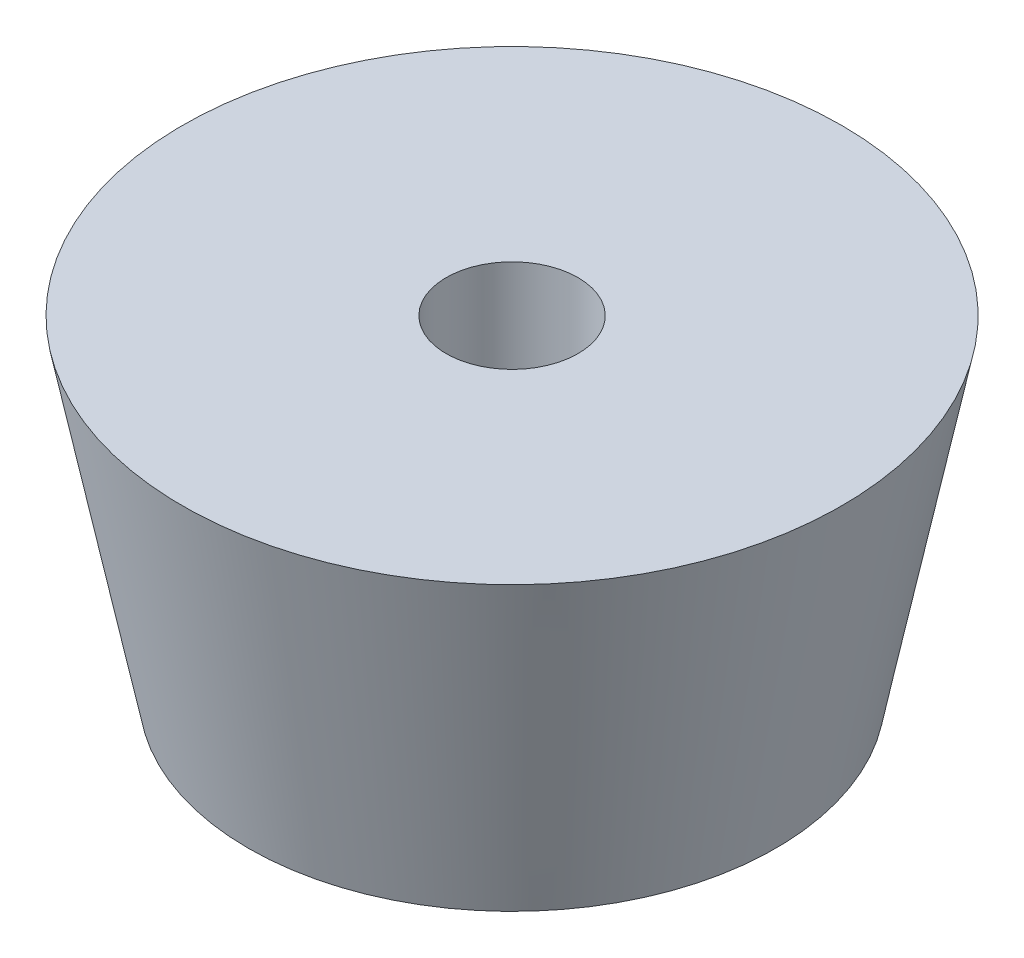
ISO-10303-21;
HEADER;
FILE_DESCRIPTION(('STEP AP214'),'2;1');
FILE_NAME('part.step','',(''),(''),'','','');
FILE_SCHEMA(('AUTOMOTIVE_DESIGN { 1 0 10303 214 1 1 1 1 }'));
ENDSEC;
DATA;
#1=APPLICATION_CONTEXT('core data for automotive mechanical design processes');
#2=APPLICATION_PROTOCOL_DEFINITION('international standard','automotive_design',2000,#1);
#3=PRODUCT_CONTEXT('',#1,'mechanical');
#4=PRODUCT('Part','Part','',(#3));
#5=PRODUCT_RELATED_PRODUCT_CATEGORY('part','',(#4));
#6=PRODUCT_DEFINITION_FORMATION('','',#4);
#7=PRODUCT_DEFINITION_CONTEXT('part definition',#1,'design');
#8=PRODUCT_DEFINITION('design','',#6,#7);
#9=PRODUCT_DEFINITION_SHAPE('','',#8);
#10=(LENGTH_UNIT() NAMED_UNIT(*) SI_UNIT(.MILLI.,.METRE.));
#11=(NAMED_UNIT(*) PLANE_ANGLE_UNIT() SI_UNIT($,.RADIAN.));
#12=(NAMED_UNIT(*) SI_UNIT($,.STERADIAN.) SOLID_ANGLE_UNIT());
#13=UNCERTAINTY_MEASURE_WITH_UNIT(LENGTH_MEASURE(1.E-05),#10,'distance_accuracy_value','');
#14=(GEOMETRIC_REPRESENTATION_CONTEXT(3) GLOBAL_UNCERTAINTY_ASSIGNED_CONTEXT((#13)) GLOBAL_UNIT_ASSIGNED_CONTEXT((#10,
#11,#12)) REPRESENTATION_CONTEXT('',''));
#15=CARTESIAN_POINT('',(0.,0.,0.));
#16=DIRECTION('',(0.,0.,1.));
#17=DIRECTION('',(1.,0.,0.));
#18=AXIS2_PLACEMENT_3D('',#15,#16,#17);
#19=CARTESIAN_POINT('',(0.,0.,0.));
#20=DIRECTION('',(0.,-1.,0.));
#21=DIRECTION('',(0.,0.,-1.));
#22=AXIS2_PLACEMENT_3D('',#19,#20,#21);
#23=CYLINDRICAL_SURFACE('',#22,3.175);
#24=CARTESIAN_POINT('',(0.,15.875,0.));
#25=DIRECTION('',(0.,-1.,0.));
#26=DIRECTION('',(0.,0.,-1.));
#27=AXIS2_PLACEMENT_3D('',#24,#25,#26);
#28=CIRCLE('',#27,3.175);
#29=CARTESIAN_POINT('',(0.,15.875,-3.175));
#30=VERTEX_POINT('',#29);
#31=EDGE_CURVE('E11',#30,#30,#28,.T.);
#32=ORIENTED_EDGE('',*,*,#31,.F.);
#33=EDGE_LOOP('',(#32));
#34=FACE_BOUND('',#33,.T.);
#35=CARTESIAN_POINT('',(0.,8.255,0.));
#36=DIRECTION('',(0.,-1.,0.));
#37=DIRECTION('',(0.,0.,-1.));
#38=AXIS2_PLACEMENT_3D('',#35,#36,#37);
#39=CIRCLE('',#38,3.175);
#40=CARTESIAN_POINT('',(0.,8.255,-3.175));
#41=VERTEX_POINT('',#40);
#42=EDGE_CURVE('E43',#41,#41,#39,.F.);
#43=ORIENTED_EDGE('',*,*,#42,.F.);
#44=EDGE_LOOP('',(#43));
#45=FACE_BOUND('',#44,.T.);
#46=ADVANCED_FACE('F39',(#34,#45),#23,.F.);
#47=CARTESIAN_POINT('',(0.,15.875,15.875));
#48=DIRECTION('',(0.,-1.,0.));
#49=DIRECTION('',(0.,0.,-1.));
#50=AXIS2_PLACEMENT_3D('',#47,#48,#49);
#51=PLANE('',#50);
#52=CARTESIAN_POINT('',(0.,15.875,0.));
#53=DIRECTION('',(0.,-1.,0.));
#54=DIRECTION('',(0.,0.,-1.));
#55=AXIS2_PLACEMENT_3D('',#52,#53,#54);
#56=CIRCLE('',#55,15.875);
#57=CARTESIAN_POINT('',(0.,15.875,-15.875));
#58=VERTEX_POINT('',#57);
#59=EDGE_CURVE('E212',#58,#58,#56,.T.);
#60=ORIENTED_EDGE('',*,*,#59,.F.);
#61=EDGE_LOOP('',(#60));
#62=FACE_BOUND('',#61,.T.);
#63=ORIENTED_EDGE('',*,*,#31,.T.);
#64=EDGE_LOOP('',(#63));
#65=FACE_BOUND('',#64,.T.);
#66=ADVANCED_FACE('F41',(#62,#65),#51,.F.);
#67=CARTESIAN_POINT('',(0.,0.,3.175));
#68=DIRECTION('',(0.,1.,0.));
#69=DIRECTION('',(0.,0.,1.));
#70=AXIS2_PLACEMENT_3D('',#67,#68,#69);
#71=PLANE('',#70);
#72=DIRECTION('',(0.500000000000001,0.,-0.866025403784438));
#73=VECTOR('',#72,1.);
#74=CARTESIAN_POINT('',(-3.42655678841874,0.,-5.4950295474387));
#75=LINE('',#74,#73);
#76=CARTESIAN_POINT('',(-6.47211357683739,0.,-0.219970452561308));
#77=VERTEX_POINT('',#76);
#78=CARTESIAN_POINT('',(-3.42655678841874,0.,-5.4950295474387));
#79=VERTEX_POINT('',#78);
#80=EDGE_CURVE('E167',#77,#79,#75,.T.);
#81=ORIENTED_EDGE('',*,*,#80,.F.);
#82=CARTESIAN_POINT('',(-6.59911357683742,0.,0.));
#83=DIRECTION('',(0.,-1.,0.));
#84=DIRECTION('',(0.,0.,-1.));
#85=AXIS2_PLACEMENT_3D('',#82,#83,#84);
#86=CIRCLE('',#85,0.254000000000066);
#87=CARTESIAN_POINT('',(-6.47211357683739,0.,0.219970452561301));
#88=VERTEX_POINT('',#87);
#89=EDGE_CURVE('E54',#88,#77,#86,.T.);
#90=ORIENTED_EDGE('',*,*,#89,.F.);
#91=DIRECTION('',(-0.5,0.,-0.866025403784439));
#92=VECTOR('',#91,1.);
#93=CARTESIAN_POINT('',(-6.47211357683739,0.,0.219970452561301));
#94=LINE('',#93,#92);
#95=CARTESIAN_POINT('',(-3.42655678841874,0.,5.4950295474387));
#96=VERTEX_POINT('',#95);
#97=EDGE_CURVE('E195',#96,#88,#94,.T.);
#98=ORIENTED_EDGE('',*,*,#97,.F.);
#99=CARTESIAN_POINT('',(-3.29955678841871,0.,5.715));
#100=DIRECTION('',(0.,-1.,0.));
#101=DIRECTION('',(0.,0.,-1.));
#102=AXIS2_PLACEMENT_3D('',#99,#100,#101);
#103=CIRCLE('',#102,0.254000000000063);
#104=CARTESIAN_POINT('',(-3.04555678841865,0.,5.715));
#105=VERTEX_POINT('',#104);
#106=EDGE_CURVE('E192',#105,#96,#103,.T.);
#107=ORIENTED_EDGE('',*,*,#106,.F.);
#108=DIRECTION('',(-1.,0.,0.));
#109=VECTOR('',#108,1.);
#110=CARTESIAN_POINT('',(-3.04555678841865,0.,5.715));
#111=LINE('',#110,#109);
#112=CARTESIAN_POINT('',(3.04555678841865,0.,5.715));
#113=VERTEX_POINT('',#112);
#114=EDGE_CURVE('E136',#113,#105,#111,.T.);
#115=ORIENTED_EDGE('',*,*,#114,.F.);
#116=CARTESIAN_POINT('',(3.29955678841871,0.,5.715));
#117=DIRECTION('',(0.,-1.,0.));
#118=DIRECTION('',(0.,0.,-1.));
#119=AXIS2_PLACEMENT_3D('',#116,#117,#118);
#120=CIRCLE('',#119,0.254000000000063);
#121=CARTESIAN_POINT('',(3.42655678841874,0.,5.4950295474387));
#122=VERTEX_POINT('',#121);
#123=EDGE_CURVE('E186',#122,#113,#120,.T.);
#124=ORIENTED_EDGE('',*,*,#123,.F.);
#125=DIRECTION('',(-0.5,0.,0.866025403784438));
#126=VECTOR('',#125,1.);
#127=CARTESIAN_POINT('',(3.42655678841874,0.,5.4950295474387));
#128=LINE('',#127,#126);
#129=CARTESIAN_POINT('',(6.47211357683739,0.,0.219970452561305));
#130=VERTEX_POINT('',#129);
#131=EDGE_CURVE('E184',#130,#122,#128,.T.);
#132=ORIENTED_EDGE('',*,*,#131,.F.);
#133=CARTESIAN_POINT('',(6.59911357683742,0.,0.));
#134=DIRECTION('',(0.,-1.,0.));
#135=DIRECTION('',(0.,0.,-1.));
#136=AXIS2_PLACEMENT_3D('',#133,#134,#135);
#137=CIRCLE('',#136,0.254000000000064);
#138=CARTESIAN_POINT('',(6.47211357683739,0.,-0.2199704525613));
#139=VERTEX_POINT('',#138);
#140=EDGE_CURVE('E182',#139,#130,#137,.T.);
#141=ORIENTED_EDGE('',*,*,#140,.F.);
#142=DIRECTION('',(0.5,0.,0.866025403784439));
#143=VECTOR('',#142,1.);
#144=CARTESIAN_POINT('',(6.47211357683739,0.,-0.219970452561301));
#145=LINE('',#144,#143);
#146=CARTESIAN_POINT('',(3.42655678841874,0.,-5.4950295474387));
#147=VERTEX_POINT('',#146);
#148=EDGE_CURVE('E180',#147,#139,#145,.T.);
#149=ORIENTED_EDGE('',*,*,#148,.F.);
#150=CARTESIAN_POINT('',(3.29955678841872,0.,-5.715));
#151=DIRECTION('',(0.,-1.,0.));
#152=DIRECTION('',(0.,0.,-1.));
#153=AXIS2_PLACEMENT_3D('',#150,#151,#152);
#154=CIRCLE('',#153,0.254000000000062);
#155=CARTESIAN_POINT('',(3.04555678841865,0.,-5.715));
#156=VERTEX_POINT('',#155);
#157=EDGE_CURVE('E172',#156,#147,#154,.T.);
#158=ORIENTED_EDGE('',*,*,#157,.F.);
#159=DIRECTION('',(1.,0.,0.));
#160=VECTOR('',#159,1.);
#161=CARTESIAN_POINT('',(3.04555678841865,0.,-5.715));
#162=LINE('',#161,#160);
#163=CARTESIAN_POINT('',(-3.04555678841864,0.,-5.715));
#164=VERTEX_POINT('',#163);
#165=EDGE_CURVE('E171',#164,#156,#162,.T.);
#166=ORIENTED_EDGE('',*,*,#165,.F.);
#167=CARTESIAN_POINT('',(-3.29955678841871,0.,-5.715));
#168=DIRECTION('',(0.,-1.,0.));
#169=DIRECTION('',(0.,0.,-1.));
#170=AXIS2_PLACEMENT_3D('',#167,#168,#169);
#171=CIRCLE('',#170,0.254000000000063);
#172=EDGE_CURVE('E166',#79,#164,#171,.T.);
#173=ORIENTED_EDGE('',*,*,#172,.F.);
#174=EDGE_LOOP('',(#81,#90,#98,#107,#115,#124,#132,#141,#149,#158,#166,#173));
#175=FACE_BOUND('',#174,.T.);
#176=CARTESIAN_POINT('',(0.,0.,0.));
#177=DIRECTION('',(0.,-1.,0.));
#178=DIRECTION('',(0.,0.,-1.));
#179=AXIS2_PLACEMENT_3D('',#176,#177,#178);
#180=CIRCLE('',#179,12.7);
#181=CARTESIAN_POINT('',(0.,0.,-12.7));
#182=VERTEX_POINT('',#181);
#183=EDGE_CURVE('E48',#182,#182,#180,.T.);
#184=ORIENTED_EDGE('',*,*,#183,.T.);
#185=EDGE_LOOP('',(#184));
#186=FACE_BOUND('',#185,.T.);
#187=ADVANCED_FACE('F219',(#175,#186),#71,.F.);
#188=CARTESIAN_POINT('',(0.,15.875,0.));
#189=DIRECTION('',(0.,1.,0.));
#190=DIRECTION('',(0.,0.,1.));
#191=AXIS2_PLACEMENT_3D('',#188,#189,#190);
#192=CONICAL_SURFACE('',#191,15.875,0.197395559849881);
#193=ORIENTED_EDGE('',*,*,#183,.F.);
#194=EDGE_LOOP('',(#193));
#195=FACE_BOUND('',#194,.T.);
#196=ORIENTED_EDGE('',*,*,#59,.T.);
#197=EDGE_LOOP('',(#196));
#198=FACE_BOUND('',#197,.T.);
#199=ADVANCED_FACE('F225',(#195,#198),#192,.T.);
#200=CARTESIAN_POINT('',(-6.59911357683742,8.255,0.));
#201=DIRECTION('',(0.,-1.,0.));
#202=DIRECTION('',(0.,0.,-1.));
#203=AXIS2_PLACEMENT_3D('',#200,#201,#202);
#204=PLANE('',#203);
#205=CARTESIAN_POINT('',(-6.59911357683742,8.255,0.));
#206=DIRECTION('',(0.,-1.,0.));
#207=DIRECTION('',(0.,0.,-1.));
#208=AXIS2_PLACEMENT_3D('',#205,#206,#207);
#209=CIRCLE('',#208,0.254000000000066);
#210=CARTESIAN_POINT('',(-6.47211357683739,8.255,0.219970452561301));
#211=VERTEX_POINT('',#210);
#212=CARTESIAN_POINT('',(-6.47211357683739,8.255,-0.219970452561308));
#213=VERTEX_POINT('',#212);
#214=EDGE_CURVE('E193',#211,#213,#209,.T.);
#215=ORIENTED_EDGE('',*,*,#214,.T.);
#216=DIRECTION('',(0.500000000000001,0.,-0.866025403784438));
#217=VECTOR('',#216,1.);
#218=CARTESIAN_POINT('',(-3.42655678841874,8.255,-5.4950295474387));
#219=LINE('',#218,#217);
#220=CARTESIAN_POINT('',(-3.42655678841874,8.255,-5.4950295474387));
#221=VERTEX_POINT('',#220);
#222=EDGE_CURVE('E291',#213,#221,#219,.T.);
#223=ORIENTED_EDGE('',*,*,#222,.T.);
#224=CARTESIAN_POINT('',(-3.29955678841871,8.255,-5.715));
#225=DIRECTION('',(0.,-1.,0.));
#226=DIRECTION('',(0.,0.,-1.));
#227=AXIS2_PLACEMENT_3D('',#224,#225,#226);
#228=CIRCLE('',#227,0.254000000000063);
#229=CARTESIAN_POINT('',(-3.04555678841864,8.255,-5.715));
#230=VERTEX_POINT('',#229);
#231=EDGE_CURVE('E293',#221,#230,#228,.T.);
#232=ORIENTED_EDGE('',*,*,#231,.T.);
#233=DIRECTION('',(1.,0.,0.));
#234=VECTOR('',#233,1.);
#235=CARTESIAN_POINT('',(3.04555678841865,8.255,-5.715));
#236=LINE('',#235,#234);
#237=CARTESIAN_POINT('',(3.04555678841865,8.255,-5.715));
#238=VERTEX_POINT('',#237);
#239=EDGE_CURVE('E297',#230,#238,#236,.T.);
#240=ORIENTED_EDGE('',*,*,#239,.T.);
#241=CARTESIAN_POINT('',(3.29955678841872,8.255,-5.715));
#242=DIRECTION('',(0.,-1.,0.));
#243=DIRECTION('',(0.,0.,-1.));
#244=AXIS2_PLACEMENT_3D('',#241,#242,#243);
#245=CIRCLE('',#244,0.254000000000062);
#246=CARTESIAN_POINT('',(3.42655678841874,8.255,-5.4950295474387));
#247=VERTEX_POINT('',#246);
#248=EDGE_CURVE('E305',#238,#247,#245,.T.);
#249=ORIENTED_EDGE('',*,*,#248,.T.);
#250=DIRECTION('',(0.5,0.,0.866025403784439));
#251=VECTOR('',#250,1.);
#252=CARTESIAN_POINT('',(6.47211357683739,8.255,-0.219970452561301));
#253=LINE('',#252,#251);
#254=CARTESIAN_POINT('',(6.47211357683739,8.255,-0.2199704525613));
#255=VERTEX_POINT('',#254);
#256=EDGE_CURVE('E308',#247,#255,#253,.T.);
#257=ORIENTED_EDGE('',*,*,#256,.T.);
#258=CARTESIAN_POINT('',(6.59911357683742,8.255,0.));
#259=DIRECTION('',(0.,-1.,0.));
#260=DIRECTION('',(0.,0.,-1.));
#261=AXIS2_PLACEMENT_3D('',#258,#259,#260);
#262=CIRCLE('',#261,0.254000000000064);
#263=CARTESIAN_POINT('',(6.47211357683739,8.255,0.219970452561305));
#264=VERTEX_POINT('',#263);
#265=EDGE_CURVE('E310',#255,#264,#262,.T.);
#266=ORIENTED_EDGE('',*,*,#265,.T.);
#267=DIRECTION('',(-0.5,0.,0.866025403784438));
#268=VECTOR('',#267,1.);
#269=CARTESIAN_POINT('',(3.42655678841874,8.255,5.4950295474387));
#270=LINE('',#269,#268);
#271=CARTESIAN_POINT('',(3.42655678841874,8.255,5.4950295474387));
#272=VERTEX_POINT('',#271);
#273=EDGE_CURVE('E159',#264,#272,#270,.T.);
#274=ORIENTED_EDGE('',*,*,#273,.T.);
#275=CARTESIAN_POINT('',(3.29955678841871,8.255,5.715));
#276=DIRECTION('',(0.,-1.,0.));
#277=DIRECTION('',(0.,0.,-1.));
#278=AXIS2_PLACEMENT_3D('',#275,#276,#277);
#279=CIRCLE('',#278,0.254000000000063);
#280=CARTESIAN_POINT('',(3.04555678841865,8.255,5.715));
#281=VERTEX_POINT('',#280);
#282=EDGE_CURVE('E158',#272,#281,#279,.T.);
#283=ORIENTED_EDGE('',*,*,#282,.T.);
#284=DIRECTION('',(-1.,0.,0.));
#285=VECTOR('',#284,1.);
#286=CARTESIAN_POINT('',(-3.04555678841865,8.255,5.715));
#287=LINE('',#286,#285);
#288=CARTESIAN_POINT('',(-3.04555678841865,8.255,5.715));
#289=VERTEX_POINT('',#288);
#290=EDGE_CURVE('E137',#281,#289,#287,.T.);
#291=ORIENTED_EDGE('',*,*,#290,.T.);
#292=CARTESIAN_POINT('',(-3.29955678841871,8.255,5.715));
#293=DIRECTION('',(0.,-1.,0.));
#294=DIRECTION('',(0.,0.,-1.));
#295=AXIS2_PLACEMENT_3D('',#292,#293,#294);
#296=CIRCLE('',#295,0.254000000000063);
#297=CARTESIAN_POINT('',(-3.42655678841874,8.255,5.4950295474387));
#298=VERTEX_POINT('',#297);
#299=EDGE_CURVE('E150',#289,#298,#296,.T.);
#300=ORIENTED_EDGE('',*,*,#299,.T.);
#301=DIRECTION('',(-0.5,0.,-0.866025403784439));
#302=VECTOR('',#301,1.);
#303=CARTESIAN_POINT('',(-6.47211357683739,8.255,0.219970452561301));
#304=LINE('',#303,#302);
#305=EDGE_CURVE('E151',#298,#211,#304,.T.);
#306=ORIENTED_EDGE('',*,*,#305,.T.);
#307=EDGE_LOOP('',(#215,#223,#232,#240,#249,#257,#266,#274,#283,#291,#300,#306));
#308=FACE_BOUND('',#307,.T.);
#309=ORIENTED_EDGE('',*,*,#42,.T.);
#310=EDGE_LOOP('',(#309));
#311=FACE_BOUND('',#310,.T.);
#312=ADVANCED_FACE('F152',(#308,#311),#204,.T.);
#313=CARTESIAN_POINT('',(-6.59911357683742,8.255,0.));
#314=DIRECTION('',(0.,-1.,0.));
#315=DIRECTION('',(0.,0.,-1.));
#316=AXIS2_PLACEMENT_3D('',#313,#314,#315);
#317=CYLINDRICAL_SURFACE('',#316,0.254000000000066);
#318=ORIENTED_EDGE('',*,*,#89,.T.);
#319=DIRECTION('',(0.,-1.,0.));
#320=VECTOR('',#319,1.);
#321=CARTESIAN_POINT('',(-6.47211357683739,8.255,-0.219970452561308));
#322=LINE('',#321,#320);
#323=EDGE_CURVE('E103',#213,#77,#322,.T.);
#324=ORIENTED_EDGE('',*,*,#323,.F.);
#325=ORIENTED_EDGE('',*,*,#214,.F.);
#326=DIRECTION('',(0.,-1.,0.));
#327=VECTOR('',#326,1.);
#328=CARTESIAN_POINT('',(-6.47211357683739,8.255,0.219970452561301));
#329=LINE('',#328,#327);
#330=EDGE_CURVE('E65',#211,#88,#329,.T.);
#331=ORIENTED_EDGE('',*,*,#330,.T.);
#332=EDGE_LOOP('',(#318,#324,#325,#331));
#333=FACE_BOUND('',#332,.T.);
#334=ADVANCED_FACE('F240',(#333),#317,.F.);
#335=CARTESIAN_POINT('',(-6.47211357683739,8.255,0.219970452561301));
#336=DIRECTION('',(-0.866025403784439,0.,0.5));
#337=DIRECTION('',(0.5,0.,0.866025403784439));
#338=AXIS2_PLACEMENT_3D('',#335,#336,#337);
#339=PLANE('',#338);
#340=ORIENTED_EDGE('',*,*,#97,.T.);
#341=ORIENTED_EDGE('',*,*,#330,.F.);
#342=ORIENTED_EDGE('',*,*,#305,.F.);
#343=DIRECTION('',(0.,-1.,0.));
#344=VECTOR('',#343,1.);
#345=CARTESIAN_POINT('',(-3.42655678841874,8.255,5.4950295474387));
#346=LINE('',#345,#344);
#347=EDGE_CURVE('E141',#298,#96,#346,.T.);
#348=ORIENTED_EDGE('',*,*,#347,.T.);
#349=EDGE_LOOP('',(#340,#341,#342,#348));
#350=FACE_BOUND('',#349,.T.);
#351=ADVANCED_FACE('F245',(#350),#339,.F.);
#352=CARTESIAN_POINT('',(-3.29955678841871,8.255,5.715));
#353=DIRECTION('',(0.,-1.,0.));
#354=DIRECTION('',(0.,0.,-1.));
#355=AXIS2_PLACEMENT_3D('',#352,#353,#354);
#356=CYLINDRICAL_SURFACE('',#355,0.254000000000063);
#357=ORIENTED_EDGE('',*,*,#106,.T.);
#358=ORIENTED_EDGE('',*,*,#347,.F.);
#359=ORIENTED_EDGE('',*,*,#299,.F.);
#360=DIRECTION('',(0.,-1.,0.));
#361=VECTOR('',#360,1.);
#362=CARTESIAN_POINT('',(-3.04555678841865,8.255,5.715));
#363=LINE('',#362,#361);
#364=EDGE_CURVE('E131',#289,#105,#363,.T.);
#365=ORIENTED_EDGE('',*,*,#364,.T.);
#366=EDGE_LOOP('',(#357,#358,#359,#365));
#367=FACE_BOUND('',#366,.T.);
#368=ADVANCED_FACE('F146',(#367),#356,.F.);
#369=CARTESIAN_POINT('',(-3.04555678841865,8.255,5.715));
#370=DIRECTION('',(0.,0.,1.));
#371=DIRECTION('',(1.,0.,0.));
#372=AXIS2_PLACEMENT_3D('',#369,#370,#371);
#373=PLANE('',#372);
#374=ORIENTED_EDGE('',*,*,#114,.T.);
#375=ORIENTED_EDGE('',*,*,#364,.F.);
#376=ORIENTED_EDGE('',*,*,#290,.F.);
#377=DIRECTION('',(0.,-1.,0.));
#378=VECTOR('',#377,1.);
#379=CARTESIAN_POINT('',(3.04555678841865,8.255,5.715));
#380=LINE('',#379,#378);
#381=EDGE_CURVE('E145',#281,#113,#380,.T.);
#382=ORIENTED_EDGE('',*,*,#381,.T.);
#383=EDGE_LOOP('',(#374,#375,#376,#382));
#384=FACE_BOUND('',#383,.T.);
#385=ADVANCED_FACE('F133',(#384),#373,.F.);
#386=CARTESIAN_POINT('',(3.29955678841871,8.255,5.715));
#387=DIRECTION('',(0.,-1.,0.));
#388=DIRECTION('',(0.,0.,-1.));
#389=AXIS2_PLACEMENT_3D('',#386,#387,#388);
#390=CYLINDRICAL_SURFACE('',#389,0.254000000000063);
#391=ORIENTED_EDGE('',*,*,#123,.T.);
#392=ORIENTED_EDGE('',*,*,#381,.F.);
#393=ORIENTED_EDGE('',*,*,#282,.F.);
#394=DIRECTION('',(0.,-1.,0.));
#395=VECTOR('',#394,1.);
#396=CARTESIAN_POINT('',(3.42655678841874,8.255,5.4950295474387));
#397=LINE('',#396,#395);
#398=EDGE_CURVE('E200',#272,#122,#397,.T.);
#399=ORIENTED_EDGE('',*,*,#398,.T.);
#400=EDGE_LOOP('',(#391,#392,#393,#399));
#401=FACE_BOUND('',#400,.T.);
#402=ADVANCED_FACE('F252',(#401),#390,.F.);
#403=CARTESIAN_POINT('',(3.42655678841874,8.255,5.4950295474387));
#404=DIRECTION('',(0.866025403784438,0.,0.5));
#405=DIRECTION('',(0.5,0.,-0.866025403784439));
#406=AXIS2_PLACEMENT_3D('',#403,#404,#405);
#407=PLANE('',#406);
#408=ORIENTED_EDGE('',*,*,#131,.T.);
#409=ORIENTED_EDGE('',*,*,#398,.F.);
#410=ORIENTED_EDGE('',*,*,#273,.F.);
#411=DIRECTION('',(0.,-1.,0.));
#412=VECTOR('',#411,1.);
#413=CARTESIAN_POINT('',(6.47211357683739,8.255,0.219970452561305));
#414=LINE('',#413,#412);
#415=EDGE_CURVE('E203',#264,#130,#414,.T.);
#416=ORIENTED_EDGE('',*,*,#415,.T.);
#417=EDGE_LOOP('',(#408,#409,#410,#416));
#418=FACE_BOUND('',#417,.T.);
#419=ADVANCED_FACE('F254',(#418),#407,.F.);
#420=CARTESIAN_POINT('',(6.59911357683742,8.255,0.));
#421=DIRECTION('',(0.,-1.,0.));
#422=DIRECTION('',(0.,0.,-1.));
#423=AXIS2_PLACEMENT_3D('',#420,#421,#422);
#424=CYLINDRICAL_SURFACE('',#423,0.254000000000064);
#425=ORIENTED_EDGE('',*,*,#140,.T.);
#426=ORIENTED_EDGE('',*,*,#415,.F.);
#427=ORIENTED_EDGE('',*,*,#265,.F.);
#428=DIRECTION('',(0.,-1.,0.));
#429=VECTOR('',#428,1.);
#430=CARTESIAN_POINT('',(6.47211357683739,8.255,-0.2199704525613));
#431=LINE('',#430,#429);
#432=EDGE_CURVE('E201',#255,#139,#431,.T.);
#433=ORIENTED_EDGE('',*,*,#432,.T.);
#434=EDGE_LOOP('',(#425,#426,#427,#433));
#435=FACE_BOUND('',#434,.T.);
#436=ADVANCED_FACE('F259',(#435),#424,.F.);
#437=CARTESIAN_POINT('',(6.47211357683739,8.255,-0.219970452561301));
#438=DIRECTION('',(0.866025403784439,0.,-0.5));
#439=DIRECTION('',(-0.5,0.,-0.866025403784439));
#440=AXIS2_PLACEMENT_3D('',#437,#438,#439);
#441=PLANE('',#440);
#442=ORIENTED_EDGE('',*,*,#148,.T.);
#443=ORIENTED_EDGE('',*,*,#432,.F.);
#444=ORIENTED_EDGE('',*,*,#256,.F.);
#445=DIRECTION('',(0.,-1.,0.));
#446=VECTOR('',#445,1.);
#447=CARTESIAN_POINT('',(3.42655678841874,8.255,-5.4950295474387));
#448=LINE('',#447,#446);
#449=EDGE_CURVE('E202',#247,#147,#448,.T.);
#450=ORIENTED_EDGE('',*,*,#449,.T.);
#451=EDGE_LOOP('',(#442,#443,#444,#450));
#452=FACE_BOUND('',#451,.T.);
#453=ADVANCED_FACE('F263',(#452),#441,.F.);
#454=CARTESIAN_POINT('',(3.29955678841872,8.255,-5.715));
#455=DIRECTION('',(0.,-1.,0.));
#456=DIRECTION('',(0.,0.,-1.));
#457=AXIS2_PLACEMENT_3D('',#454,#455,#456);
#458=CYLINDRICAL_SURFACE('',#457,0.254000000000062);
#459=ORIENTED_EDGE('',*,*,#157,.T.);
#460=ORIENTED_EDGE('',*,*,#449,.F.);
#461=ORIENTED_EDGE('',*,*,#248,.F.);
#462=DIRECTION('',(0.,-1.,0.));
#463=VECTOR('',#462,1.);
#464=CARTESIAN_POINT('',(3.04555678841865,8.255,-5.715));
#465=LINE('',#464,#463);
#466=EDGE_CURVE('E210',#238,#156,#465,.T.);
#467=ORIENTED_EDGE('',*,*,#466,.T.);
#468=EDGE_LOOP('',(#459,#460,#461,#467));
#469=FACE_BOUND('',#468,.T.);
#470=ADVANCED_FACE('F270',(#469),#458,.F.);
#471=CARTESIAN_POINT('',(3.04555678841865,8.255,-5.715));
#472=DIRECTION('',(0.,0.,-1.));
#473=DIRECTION('',(-1.,0.,0.));
#474=AXIS2_PLACEMENT_3D('',#471,#472,#473);
#475=PLANE('',#474);
#476=ORIENTED_EDGE('',*,*,#165,.T.);
#477=ORIENTED_EDGE('',*,*,#466,.F.);
#478=ORIENTED_EDGE('',*,*,#239,.F.);
#479=DIRECTION('',(0.,-1.,0.));
#480=VECTOR('',#479,1.);
#481=CARTESIAN_POINT('',(-3.04555678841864,8.255,-5.715));
#482=LINE('',#481,#480);
#483=EDGE_CURVE('E207',#230,#164,#482,.T.);
#484=ORIENTED_EDGE('',*,*,#483,.T.);
#485=EDGE_LOOP('',(#476,#477,#478,#484));
#486=FACE_BOUND('',#485,.T.);
#487=ADVANCED_FACE('F271',(#486),#475,.F.);
#488=CARTESIAN_POINT('',(-3.29955678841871,8.255,-5.715));
#489=DIRECTION('',(0.,-1.,0.));
#490=DIRECTION('',(0.,0.,-1.));
#491=AXIS2_PLACEMENT_3D('',#488,#489,#490);
#492=CYLINDRICAL_SURFACE('',#491,0.254000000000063);
#493=ORIENTED_EDGE('',*,*,#172,.T.);
#494=ORIENTED_EDGE('',*,*,#483,.F.);
#495=ORIENTED_EDGE('',*,*,#231,.F.);
#496=DIRECTION('',(0.,-1.,0.));
#497=VECTOR('',#496,1.);
#498=CARTESIAN_POINT('',(-3.42655678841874,8.255,-5.4950295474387));
#499=LINE('',#498,#497);
#500=EDGE_CURVE('E211',#221,#79,#499,.T.);
#501=ORIENTED_EDGE('',*,*,#500,.T.);
#502=EDGE_LOOP('',(#493,#494,#495,#501));
#503=FACE_BOUND('',#502,.T.);
#504=ADVANCED_FACE('F274',(#503),#492,.F.);
#505=CARTESIAN_POINT('',(-3.42655678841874,8.255,-5.4950295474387));
#506=DIRECTION('',(-0.866025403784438,0.,-0.500000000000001));
#507=DIRECTION('',(-0.500000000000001,0.,0.866025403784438));
#508=AXIS2_PLACEMENT_3D('',#505,#506,#507);
#509=PLANE('',#508);
#510=ORIENTED_EDGE('',*,*,#80,.T.);
#511=ORIENTED_EDGE('',*,*,#500,.F.);
#512=ORIENTED_EDGE('',*,*,#222,.F.);
#513=ORIENTED_EDGE('',*,*,#323,.T.);
#514=EDGE_LOOP('',(#510,#511,#512,#513));
#515=FACE_BOUND('',#514,.T.);
#516=ADVANCED_FACE('F276',(#515),#509,.F.);
#517=CLOSED_SHELL('',(#46,#66,#187,#199,#312,#334,#351,#368,#385,#402,#419,#436,#453,#470,#487,
#504,#516));
#518=MANIFOLD_SOLID_BREP('B2',#517);
#519=ADVANCED_BREP_SHAPE_REPRESENTATION('',(#18,#518),#14);
#520=SHAPE_DEFINITION_REPRESENTATION(#9,#519);
ENDSEC;
END-ISO-10303-21;
